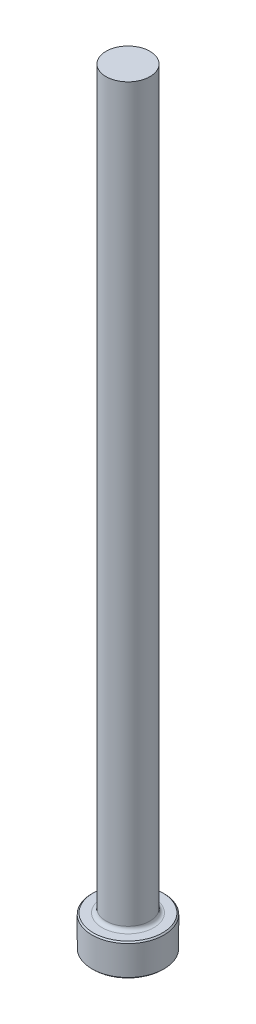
from build123d import *

# Parameters (mm, degrees)
CHAMFER1_SIZE = 0.254
FILLET1_R     = 0.762


with BuildPart() as part:
    # Sketch1 → Revolve1 (revolve)
    with BuildSketch(Plane.XY, mode=Mode.PRIVATE) as revolve1_sk:
        Polygon((0, 0), (-7.1374, 0), (-7.1374, 6.35), (-4.36499, 6.35), (-4.36499, 152.4), (0, 152.4), align=None)
    revolve(revolve1_sk.sketch.rotate(Axis((0, 259.958771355, 0), (0, -1, 0)), 270), axis=Axis((0, 259.958771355, 0), (0, -1, 0)))

    # Chamfer1
    chamfer1_edges = [part.edges().sort_by_distance(p)[0] for p in [
        (0, 6.35, -7.1374),
        (0, 0, -7.1374),
    ]]
    chamfer(chamfer1_edges, length=CHAMFER1_SIZE)

    # Fillet1
    fillet1_edges = [part.edges().sort_by_distance(p)[0] for p in [
        (0, 6.35, -4.36499),
    ]]
    fillet(fillet1_edges, radius=FILLET1_R)


solid = part.part
